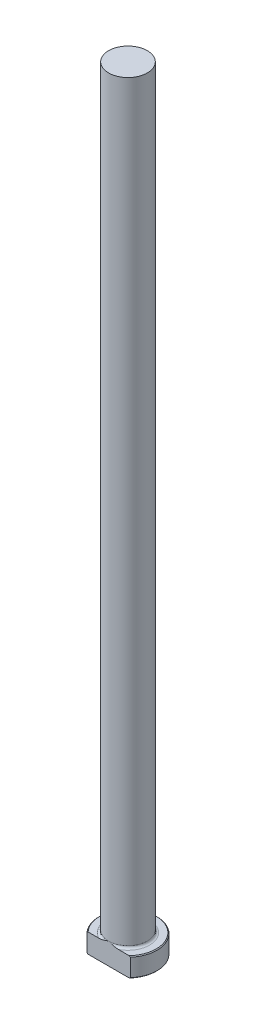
ISO-10303-21;
HEADER;
FILE_DESCRIPTION(('STEP AP214'),'2;1');
FILE_NAME('part.step','',(''),(''),'','','');
FILE_SCHEMA(('AUTOMOTIVE_DESIGN { 1 0 10303 214 1 1 1 1 }'));
ENDSEC;
DATA;
#1=APPLICATION_CONTEXT('core data for automotive mechanical design processes');
#2=APPLICATION_PROTOCOL_DEFINITION('international standard','automotive_design',2000,#1);
#3=PRODUCT_CONTEXT('',#1,'mechanical');
#4=PRODUCT('Part','Part','',(#3));
#5=PRODUCT_RELATED_PRODUCT_CATEGORY('part','',(#4));
#6=PRODUCT_DEFINITION_FORMATION('','',#4);
#7=PRODUCT_DEFINITION_CONTEXT('part definition',#1,'design');
#8=PRODUCT_DEFINITION('design','',#6,#7);
#9=PRODUCT_DEFINITION_SHAPE('','',#8);
#10=(LENGTH_UNIT() NAMED_UNIT(*) SI_UNIT(.MILLI.,.METRE.));
#11=(NAMED_UNIT(*) PLANE_ANGLE_UNIT() SI_UNIT($,.RADIAN.));
#12=(NAMED_UNIT(*) SI_UNIT($,.STERADIAN.) SOLID_ANGLE_UNIT());
#13=UNCERTAINTY_MEASURE_WITH_UNIT(LENGTH_MEASURE(1.E-05),#10,'distance_accuracy_value','');
#14=(GEOMETRIC_REPRESENTATION_CONTEXT(3) GLOBAL_UNCERTAINTY_ASSIGNED_CONTEXT((#13)) GLOBAL_UNIT_ASSIGNED_CONTEXT((#10,
#11,#12)) REPRESENTATION_CONTEXT('',''));
#15=CARTESIAN_POINT('',(0.,0.,0.));
#16=DIRECTION('',(0.,0.,1.));
#17=DIRECTION('',(1.,0.,0.));
#18=AXIS2_PLACEMENT_3D('',#15,#16,#17);
#19=CARTESIAN_POINT('',(0.,0.,0.));
#20=DIRECTION('',(0.,-1.,0.));
#21=DIRECTION('',(0.,0.,-1.));
#22=AXIS2_PLACEMENT_3D('',#19,#20,#21);
#23=PLANE('',#22);
#24=CARTESIAN_POINT('',(0.,0.,0.));
#25=DIRECTION('',(0.,-1.,0.));
#26=DIRECTION('',(0.,0.,-1.));
#27=AXIS2_PLACEMENT_3D('',#24,#25,#26);
#28=CIRCLE('',#27,9.271);
#29=CARTESIAN_POINT('',(-6.75491976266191,0.,6.34999999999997));
#30=VERTEX_POINT('',#29);
#31=CARTESIAN_POINT('',(6.75491976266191,0.,6.34999999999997));
#32=VERTEX_POINT('',#31);
#33=EDGE_CURVE('E98',#30,#32,#28,.T.);
#34=ORIENTED_EDGE('',*,*,#33,.T.);
#35=DIRECTION('',(-1.,0.,0.));
#36=VECTOR('',#35,1.);
#37=CARTESIAN_POINT('',(-7.09951582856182,0.,6.34999999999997));
#38=LINE('',#37,#36);
#39=EDGE_CURVE('E83',#32,#30,#38,.T.);
#40=ORIENTED_EDGE('',*,*,#39,.T.);
#41=EDGE_LOOP('',(#34,#40));
#42=FACE_BOUND('',#41,.T.);
#43=ADVANCED_FACE('F32',(#42),#23,.T.);
#44=CARTESIAN_POINT('',(0.,259.958771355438,0.));
#45=DIRECTION('',(0.,1.,0.));
#46=DIRECTION('',(0.,0.,1.));
#47=AXIS2_PLACEMENT_3D('',#44,#45,#46);
#48=CYLINDRICAL_SURFACE('',#47,9.52499999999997);
#49=CARTESIAN_POINT('',(0.,6.09600000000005,0.));
#50=DIRECTION('',(0.,1.,0.));
#51=DIRECTION('',(0.,0.,1.));
#52=AXIS2_PLACEMENT_3D('',#49,#50,#51);
#53=CIRCLE('',#52,9.52499999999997);
#54=CARTESIAN_POINT('',(-7.09951582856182,6.09600000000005,6.34999999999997));
#55=VERTEX_POINT('',#54);
#56=CARTESIAN_POINT('',(7.09951582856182,6.09600000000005,6.34999999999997));
#57=VERTEX_POINT('',#56);
#58=EDGE_CURVE('E104',#55,#57,#53,.F.);
#59=ORIENTED_EDGE('',*,*,#58,.T.);
#60=DIRECTION('',(0.,-1.,0.));
#61=VECTOR('',#60,1.);
#62=CARTESIAN_POINT('',(7.09951582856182,254.,6.34999999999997));
#63=LINE('',#62,#61);
#64=CARTESIAN_POINT('',(7.09951582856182,0.253999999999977,6.34999999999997));
#65=VERTEX_POINT('',#64);
#66=EDGE_CURVE('E183',#57,#65,#63,.T.);
#67=ORIENTED_EDGE('',*,*,#66,.T.);
#68=CARTESIAN_POINT('',(0.,0.253999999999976,0.));
#69=DIRECTION('',(0.,-1.,0.));
#70=DIRECTION('',(0.,0.,-1.));
#71=AXIS2_PLACEMENT_3D('',#68,#69,#70);
#72=CIRCLE('',#71,9.52499999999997);
#73=CARTESIAN_POINT('',(-7.09951582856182,0.253999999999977,6.34999999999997));
#74=VERTEX_POINT('',#73);
#75=EDGE_CURVE('E100',#65,#74,#72,.F.);
#76=ORIENTED_EDGE('',*,*,#75,.T.);
#77=DIRECTION('',(0.,-1.,0.));
#78=VECTOR('',#77,1.);
#79=CARTESIAN_POINT('',(-7.09951582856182,254.,6.34999999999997));
#80=LINE('',#79,#78);
#81=EDGE_CURVE('E93',#55,#74,#80,.T.);
#82=ORIENTED_EDGE('',*,*,#81,.F.);
#83=EDGE_LOOP('',(#59,#67,#76,#82));
#84=FACE_BOUND('',#83,.T.);
#85=ADVANCED_FACE('F158',(#84),#48,.T.);
#86=CARTESIAN_POINT('',(-9.52499999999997,6.35,0.));
#87=DIRECTION('',(0.,1.,0.));
#88=DIRECTION('',(0.,0.,1.));
#89=AXIS2_PLACEMENT_3D('',#86,#87,#88);
#90=PLANE('',#89);
#91=CARTESIAN_POINT('',(0.,6.35,0.));
#92=DIRECTION('',(0.,1.,0.));
#93=DIRECTION('',(0.,0.,1.));
#94=AXIS2_PLACEMENT_3D('',#91,#92,#93);
#95=CIRCLE('',#94,9.27100000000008);
#96=CARTESIAN_POINT('',(6.75491976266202,6.35,6.34999999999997));
#97=VERTEX_POINT('',#96);
#98=CARTESIAN_POINT('',(-6.75491976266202,6.35,6.34999999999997));
#99=VERTEX_POINT('',#98);
#100=EDGE_CURVE('E178',#97,#99,#95,.T.);
#101=ORIENTED_EDGE('',*,*,#100,.T.);
#102=DIRECTION('',(1.,0.,0.));
#103=VECTOR('',#102,1.);
#104=CARTESIAN_POINT('',(-9.52499999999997,6.35,6.34999999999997));
#105=LINE('',#104,#103);
#106=CARTESIAN_POINT('',(-3.20281813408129,6.35000000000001,6.34999999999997));
#107=VERTEX_POINT('',#106);
#108=EDGE_CURVE('E57',#99,#107,#105,.T.);
#109=ORIENTED_EDGE('',*,*,#108,.T.);
#110=CARTESIAN_POINT('',(0.,6.35,0.));
#111=DIRECTION('',(0.,1.,0.));
#112=DIRECTION('',(0.,0.,1.));
#113=AXIS2_PLACEMENT_3D('',#110,#111,#112);
#114=CIRCLE('',#113,7.11199999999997);
#115=CARTESIAN_POINT('',(3.20281813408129,6.35000000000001,6.34999999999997));
#116=VERTEX_POINT('',#115);
#117=EDGE_CURVE('E107',#107,#116,#114,.F.);
#118=ORIENTED_EDGE('',*,*,#117,.T.);
#119=EDGE_CURVE('E136',#116,#97,#105,.T.);
#120=ORIENTED_EDGE('',*,*,#119,.T.);
#121=EDGE_LOOP('',(#101,#109,#118,#120));
#122=FACE_BOUND('',#121,.T.);
#123=ADVANCED_FACE('F147',(#122),#90,.T.);
#124=CARTESIAN_POINT('',(0.,6.35000000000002,0.));
#125=DIRECTION('',(0.,-1.,0.));
#126=DIRECTION('',(0.,0.,-1.));
#127=AXIS2_PLACEMENT_3D('',#124,#125,#126);
#128=CONICAL_SURFACE('',#127,9.27100000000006,0.785398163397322);
#129=ORIENTED_EDGE('',*,*,#58,.F.);
#130=CARTESIAN_POINT('',(-15.620497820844,-1.24086384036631,6.34999999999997));
#131=CARTESIAN_POINT('',(-15.3857047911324,-1.02336008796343,6.34999999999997));
#132=CARTESIAN_POINT('',(-15.1505693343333,-0.806226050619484,6.34999999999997));
#133=CARTESIAN_POINT('',(-14.6795103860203,-0.372811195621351,6.34999999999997));
#134=CARTESIAN_POINT('',(-14.4435868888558,-0.156530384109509,6.34999999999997));
#135=CARTESIAN_POINT('',(-13.7343831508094,0.490949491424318,6.34999999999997));
#136=CARTESIAN_POINT('',(-13.2597703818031,0.920692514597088,6.34999999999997));
#137=CARTESIAN_POINT('',(-12.3030369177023,1.77753207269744,6.34999999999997));
#138=CARTESIAN_POINT('',(-11.8208883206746,2.20459751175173,6.34999999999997));
#139=CARTESIAN_POINT('',(-10.8502816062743,3.05140730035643,6.34999999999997));
#140=CARTESIAN_POINT('',(-10.361824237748,3.47115250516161,6.34999999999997));
#141=CARTESIAN_POINT('',(-9.47483904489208,4.21707154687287,6.34999999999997));
#142=CARTESIAN_POINT('',(-9.07790966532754,4.54513737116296,6.34999999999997));
#143=CARTESIAN_POINT('',(-8.47677412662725,5.030235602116,6.34999999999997));
#144=CARTESIAN_POINT('',(-8.27541054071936,5.19078991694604,6.34999999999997));
#145=CARTESIAN_POINT('',(-7.87046621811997,5.50907445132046,6.34999999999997));
#146=CARTESIAN_POINT('',(-7.66688552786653,5.66680472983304,6.34999999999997));
#147=CARTESIAN_POINT('',(-7.25735517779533,5.97869148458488,6.34999999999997));
#148=CARTESIAN_POINT('',(-7.05140838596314,6.13285171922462,6.34999999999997));
#149=CARTESIAN_POINT('',(-6.63647957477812,6.43702261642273,6.34999999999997));
#150=CARTESIAN_POINT('',(-6.42749769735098,6.58703347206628,6.34999999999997));
#151=CARTESIAN_POINT('',(-6.00602408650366,6.88188396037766,6.34999999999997));
#152=CARTESIAN_POINT('',(-5.79353372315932,7.02672554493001,6.34999999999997));
#153=CARTESIAN_POINT('',(-5.36434063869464,7.31000426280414,6.34999999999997));
#154=CARTESIAN_POINT('',(-5.14763839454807,7.44844211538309,6.34999999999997));
#155=CARTESIAN_POINT('',(-4.71552234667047,7.71338638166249,6.34999999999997));
#156=CARTESIAN_POINT('',(-4.50024913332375,7.84012086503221,6.34999999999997));
#157=CARTESIAN_POINT('',(-4.06421720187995,8.08391309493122,6.34999999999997));
#158=CARTESIAN_POINT('',(-3.84345787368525,8.20096975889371,6.34999999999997));
#159=CARTESIAN_POINT('',(-3.39588009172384,8.42261670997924,6.34999999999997));
#160=CARTESIAN_POINT('',(-3.16906543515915,8.52721459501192,6.34999999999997));
#161=CARTESIAN_POINT('',(-2.70873812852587,8.72055178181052,6.34999999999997));
#162=CARTESIAN_POINT('',(-2.4752273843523,8.80929554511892,6.34999999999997));
#163=CARTESIAN_POINT('',(-2.05336662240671,8.94953872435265,6.34999999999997));
#164=CARTESIAN_POINT('',(-1.86632074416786,9.00493855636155,6.34999999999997));
#165=CARTESIAN_POINT('',(-1.48854269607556,9.1014187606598,6.34999999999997));
#166=CARTESIAN_POINT('',(-1.29781098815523,9.14250091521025,6.34999999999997));
#167=CARTESIAN_POINT('',(-0.914152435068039,9.20830900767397,6.34999999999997));
#168=CARTESIAN_POINT('',(-0.721234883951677,9.23308834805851,6.34999999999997));
#169=CARTESIAN_POINT('',(-0.333938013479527,9.26515279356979,6.34999999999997));
#170=CARTESIAN_POINT('',(-0.139558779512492,9.27243891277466,6.34999999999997));
#171=CARTESIAN_POINT('',(0.249582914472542,9.26908452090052,6.34999999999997));
#172=CARTESIAN_POINT('',(0.444344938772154,9.25839414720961,6.34999999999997));
#173=CARTESIAN_POINT('',(0.832115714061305,9.2196193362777,6.34999999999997));
#174=CARTESIAN_POINT('',(1.02512432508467,9.19153352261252,6.34999999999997));
#175=CARTESIAN_POINT('',(1.40870622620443,9.11935938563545,6.34999999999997));
#176=CARTESIAN_POINT('',(1.59927002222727,9.07522133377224,6.34999999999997));
#177=CARTESIAN_POINT('',(1.97656776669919,8.97296890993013,6.34999999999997));
#178=CARTESIAN_POINT('',(2.16330153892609,8.9148538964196,6.34999999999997));
#179=CARTESIAN_POINT('',(2.55340558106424,8.77956545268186,6.34999999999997));
#180=CARTESIAN_POINT('',(2.75628314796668,8.7009832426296,6.34999999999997));
#181=CARTESIAN_POINT('',(3.15702163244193,8.53183500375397,6.34999999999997));
#182=CARTESIAN_POINT('',(3.35488038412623,8.44126390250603,6.34999999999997));
#183=CARTESIAN_POINT('',(3.74617402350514,8.25030745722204,6.34999999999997));
#184=CARTESIAN_POINT('',(3.93960103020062,8.14990608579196,6.34999999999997));
#185=CARTESIAN_POINT('',(4.32214375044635,7.94130427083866,6.34999999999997));
#186=CARTESIAN_POINT('',(4.5112600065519,7.83310481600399,6.34999999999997));
#187=CARTESIAN_POINT('',(4.88806427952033,7.60898083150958,6.34999999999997));
#188=CARTESIAN_POINT('',(5.07570450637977,7.49297632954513,6.34999999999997));
#189=CARTESIAN_POINT('',(5.44760916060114,7.25568772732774,6.34999999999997));
#190=CARTESIAN_POINT('',(5.63187351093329,7.13440350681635,6.34999999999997));
#191=CARTESIAN_POINT('',(5.99729074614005,6.88762375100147,6.34999999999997));
#192=CARTESIAN_POINT('',(6.17844648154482,6.76213242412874,6.34999999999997));
#193=CARTESIAN_POINT('',(6.53821557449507,6.50756961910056,6.34999999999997));
#194=CARTESIAN_POINT('',(6.71682895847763,6.37849817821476,6.34999999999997));
#195=CARTESIAN_POINT('',(7.09302388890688,6.1017900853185,6.34999999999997));
#196=CARTESIAN_POINT('',(7.29032688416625,5.95377527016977,6.34999999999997));
#197=CARTESIAN_POINT('',(7.682568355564,5.65464146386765,6.34999999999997));
#198=CARTESIAN_POINT('',(7.87750676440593,5.50352238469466,6.34999999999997));
#199=CARTESIAN_POINT('',(8.45932112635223,5.04627326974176,6.34999999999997));
#200=CARTESIAN_POINT('',(8.84315989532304,4.73627837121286,6.34999999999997));
#201=CARTESIAN_POINT('',(9.60509700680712,4.10866416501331,6.34999999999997));
#202=CARTESIAN_POINT('',(9.98318985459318,3.79103822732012,6.34999999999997));
#203=CARTESIAN_POINT('',(10.734716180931,3.1503109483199,6.34999999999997));
#204=CARTESIAN_POINT('',(11.1081495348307,2.82720946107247,6.34999999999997));
#205=CARTESIAN_POINT('',(11.8301543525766,2.19541462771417,6.34999999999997));
#206=CARTESIAN_POINT('',(12.1789280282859,1.88695183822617,6.34999999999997));
#207=CARTESIAN_POINT('',(12.8738739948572,1.26709898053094,6.34999999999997));
#208=CARTESIAN_POINT('',(13.2200462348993,0.955708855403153,6.34999999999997));
#209=CARTESIAN_POINT('',(13.9095994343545,0.331196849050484,6.34999999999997));
#210=CARTESIAN_POINT('',(14.2529845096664,0.0180795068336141,6.34999999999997));
#211=CARTESIAN_POINT('',(14.9379801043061,-0.610061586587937,6.34999999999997));
#212=CARTESIAN_POINT('',(15.2795906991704,-0.925085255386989,6.34999999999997));
#213=CARTESIAN_POINT('',(15.620497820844,-1.24086384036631,6.34999999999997));
#214=B_SPLINE_CURVE_WITH_KNOTS('',3,(#130,#131,#132,#133,#134,#135,#136,#137,#138,#139,#140,
#141,#142,#143,#144,#145,#146,#147,#148,#149,#150,#151,#152,#153,#154,#155,#156,#157,#158,#159,
#160,#161,#162,#163,#164,#165,#166,#167,#168,#169,#170,#171,#172,#173,#174,#175,#176,#177,#178,
#179,#180,#181,#182,#183,#184,#185,#186,#187,#188,#189,#190,#191,#192,#193,#194,#195,#196,#197,
#198,#199,#200,#201,#202,#203,#204,#205,#206,#207,#208,#209,#210,#211,#212,#213),.UNSPECIFIED.,
.F.,.F.,(4,2,2,2,2,2,2,2,2,2,2,2,2,2,2,2,2,2,2,2,2,2,2,2,2,2,2,2,2,2,2,2,2,2,2,2,2,2,2,2,2,4),
(0.,0.960166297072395,1.92033949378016,3.84109812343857,5.77331872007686,7.70531203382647,
9.25006454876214,10.0226538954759,10.7952270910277,11.5669461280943,12.3386291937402,
13.1100177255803,13.8813194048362,14.6305489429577,15.3798621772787,16.1287160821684,
16.8773589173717,17.4621154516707,18.0467991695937,18.6295579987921,19.2122830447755,
19.7966271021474,20.3810174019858,20.9672337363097,21.5534769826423,22.2056947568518,
22.8581893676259,23.5117661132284,24.1652601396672,24.8269639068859,25.4886827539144,
26.1497583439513,26.8108270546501,27.5507428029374,28.2906795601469,29.7706888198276,
31.2520340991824,32.7334189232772,34.1302286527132,35.5270655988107,36.921189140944,
38.3152528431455),.UNSPECIFIED.);
#215=EDGE_CURVE('E135',#55,#99,#214,.T.);
#216=ORIENTED_EDGE('',*,*,#215,.T.);
#217=ORIENTED_EDGE('',*,*,#100,.F.);
#218=EDGE_CURVE('E127',#97,#57,#214,.T.);
#219=ORIENTED_EDGE('',*,*,#218,.T.);
#220=EDGE_LOOP('',(#129,#216,#217,#219));
#221=FACE_BOUND('',#220,.T.);
#222=ADVANCED_FACE('F143',(#221),#128,.T.);
#223=CARTESIAN_POINT('',(0.,0.253999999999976,0.));
#224=DIRECTION('',(0.,1.,0.));
#225=DIRECTION('',(0.,0.,1.));
#226=AXIS2_PLACEMENT_3D('',#223,#224,#225);
#227=CONICAL_SURFACE('',#226,9.52499999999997,0.785398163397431);
#228=ORIENTED_EDGE('',*,*,#75,.F.);
#229=CARTESIAN_POINT('',(15.620497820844,7.59086384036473,6.34999999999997));
#230=CARTESIAN_POINT('',(15.3857047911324,7.37336008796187,6.34999999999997));
#231=CARTESIAN_POINT('',(15.1505693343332,7.15622605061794,6.34999999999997));
#232=CARTESIAN_POINT('',(14.6795103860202,6.72281119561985,6.34999999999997));
#233=CARTESIAN_POINT('',(14.4435868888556,6.50653038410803,6.34999999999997));
#234=CARTESIAN_POINT('',(13.7343831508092,5.85905050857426,6.34999999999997));
#235=CARTESIAN_POINT('',(13.2597703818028,5.42930748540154,6.34999999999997));
#236=CARTESIAN_POINT('',(12.3030369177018,4.57246792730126,6.34999999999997));
#237=CARTESIAN_POINT('',(11.8208883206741,4.14540248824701,6.34999999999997));
#238=CARTESIAN_POINT('',(10.8502816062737,3.29859269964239,6.34999999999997));
#239=CARTESIAN_POINT('',(10.3618242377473,2.87884749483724,6.34999999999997));
#240=CARTESIAN_POINT('',(9.47483904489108,2.1329284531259,6.34999999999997));
#241=CARTESIAN_POINT('',(9.0779096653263,1.80486262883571,6.34999999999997));
#242=CARTESIAN_POINT('',(8.47677412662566,1.31976439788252,6.34999999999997));
#243=CARTESIAN_POINT('',(8.27541054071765,1.15921008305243,6.34999999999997));
#244=CARTESIAN_POINT('',(7.87046621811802,0.840925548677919,6.34999999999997));
#245=CARTESIAN_POINT('',(7.66688552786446,0.683195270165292,6.34999999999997));
#246=CARTESIAN_POINT('',(7.257355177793,0.371308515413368,6.34999999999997));
#247=CARTESIAN_POINT('',(7.05140838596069,0.217148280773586,6.34999999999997));
#248=CARTESIAN_POINT('',(6.63647957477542,-0.0870226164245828,6.34999999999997));
#249=CARTESIAN_POINT('',(6.42749769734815,-0.237033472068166,6.34999999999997));
#250=CARTESIAN_POINT('',(6.00602408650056,-0.531883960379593,6.34999999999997));
#251=CARTESIAN_POINT('',(5.79353372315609,-0.676725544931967,6.34999999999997));
#252=CARTESIAN_POINT('',(5.36434063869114,-0.960004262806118,6.34999999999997));
#253=CARTESIAN_POINT('',(5.14763839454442,-1.09844211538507,6.34999999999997));
#254=CARTESIAN_POINT('',(4.71552234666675,-1.36338638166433,6.34999999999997));
#255=CARTESIAN_POINT('',(4.5002491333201,-1.49012086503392,6.34999999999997));
#256=CARTESIAN_POINT('',(4.06421720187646,-1.73391309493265,6.34999999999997));
#257=CARTESIAN_POINT('',(3.84345787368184,-1.85096975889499,6.34999999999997));
#258=CARTESIAN_POINT('',(3.39588009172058,-2.07261670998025,6.34999999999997));
#259=CARTESIAN_POINT('',(3.16906543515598,-2.17721459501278,6.34999999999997));
#260=CARTESIAN_POINT('',(2.70873812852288,-2.3705517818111,6.34999999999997));
#261=CARTESIAN_POINT('',(2.4752273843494,-2.45929554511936,6.34999999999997));
#262=CARTESIAN_POINT('',(2.05336662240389,-2.59953872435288,6.34999999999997));
#263=CARTESIAN_POINT('',(1.86632074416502,-2.6549385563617,6.34999999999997));
#264=CARTESIAN_POINT('',(1.48854269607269,-2.75141876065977,6.34999999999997));
#265=CARTESIAN_POINT('',(1.29781098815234,-2.79250091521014,6.34999999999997));
#266=CARTESIAN_POINT('',(0.914152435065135,-2.85830900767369,6.34999999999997));
#267=CARTESIAN_POINT('',(0.721234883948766,-2.88308834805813,6.34999999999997));
#268=CARTESIAN_POINT('',(0.333938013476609,-2.91515279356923,6.34999999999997));
#269=CARTESIAN_POINT('',(0.139558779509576,-2.922438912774,6.34999999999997));
#270=CARTESIAN_POINT('',(-0.249582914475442,-2.91908452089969,6.34999999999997));
#271=CARTESIAN_POINT('',(-0.444344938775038,-2.9083941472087,6.34999999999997));
#272=CARTESIAN_POINT('',(-0.832115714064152,-2.86961933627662,6.34999999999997));
#273=CARTESIAN_POINT('',(-1.0251243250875,-2.84153352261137,6.34999999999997));
#274=CARTESIAN_POINT('',(-1.4087062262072,-2.76935938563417,6.34999999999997));
#275=CARTESIAN_POINT('',(-1.59927002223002,-2.72522133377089,6.34999999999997));
#276=CARTESIAN_POINT('',(-1.97656776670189,-2.62296890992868,6.34999999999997));
#277=CARTESIAN_POINT('',(-2.16330153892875,-2.5648538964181,6.34999999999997));
#278=CARTESIAN_POINT('',(-2.55340558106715,-2.42956545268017,6.34999999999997));
#279=CARTESIAN_POINT('',(-2.75628314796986,-2.35098324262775,6.34999999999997));
#280=CARTESIAN_POINT('',(-3.15702163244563,-2.18183500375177,6.34999999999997));
#281=CARTESIAN_POINT('',(-3.35488038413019,-2.09126390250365,6.34999999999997));
#282=CARTESIAN_POINT('',(-3.7461740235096,-1.90030745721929,6.34999999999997));
#283=CARTESIAN_POINT('',(-3.93960103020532,-1.79990608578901,6.34999999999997));
#284=CARTESIAN_POINT('',(-4.32214375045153,-1.59130427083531,6.34999999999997));
#285=CARTESIAN_POINT('',(-4.51126000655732,-1.48310481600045,6.34999999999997));
#286=CARTESIAN_POINT('',(-4.88806427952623,-1.25898083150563,6.34999999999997));
#287=CARTESIAN_POINT('',(-5.0757045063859,-1.14297632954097,6.34999999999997));
#288=CARTESIAN_POINT('',(-5.44760916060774,-0.905687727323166,6.34999999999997));
#289=CARTESIAN_POINT('',(-5.63187351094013,-0.784403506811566,6.34999999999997));
#290=CARTESIAN_POINT('',(-5.99729074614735,-0.537623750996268,6.34999999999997));
#291=CARTESIAN_POINT('',(-6.17844648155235,-0.412132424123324,6.34999999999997));
#292=CARTESIAN_POINT('',(-6.53821557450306,-0.157569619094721,6.34999999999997));
#293=CARTESIAN_POINT('',(-6.71682895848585,-0.0284981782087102,6.34999999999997));
#294=CARTESIAN_POINT('',(-7.09302388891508,0.248209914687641,6.34999999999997));
#295=CARTESIAN_POINT('',(-7.29032688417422,0.396224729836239,6.34999999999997));
#296=CARTESIAN_POINT('',(-7.68256835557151,0.695358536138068,6.34999999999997));
#297=CARTESIAN_POINT('',(-7.87750676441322,0.846477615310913,6.34999999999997));
#298=CARTESIAN_POINT('',(-8.45932112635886,1.30372673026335,6.34999999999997));
#299=CARTESIAN_POINT('',(-8.84315989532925,1.61372162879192,6.34999999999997));
#300=CARTESIAN_POINT('',(-9.60509700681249,2.24133583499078,6.34999999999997));
#301=CARTESIAN_POINT('',(-9.98318985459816,2.5589617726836,6.34999999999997));
#302=CARTESIAN_POINT('',(-10.7347161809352,3.19968905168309,6.34999999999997));
#303=CARTESIAN_POINT('',(-11.1081495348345,3.52279053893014,6.34999999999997));
#304=CARTESIAN_POINT('',(-11.8301543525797,4.15458537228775,6.34999999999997));
#305=CARTESIAN_POINT('',(-12.1789280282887,4.46304816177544,6.34999999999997));
#306=CARTESIAN_POINT('',(-12.8738739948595,5.08290101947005,6.34999999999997));
#307=CARTESIAN_POINT('',(-13.2200462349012,5.39429114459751,6.34999999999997));
#308=CARTESIAN_POINT('',(-13.9095994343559,6.01880315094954,6.34999999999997));
#309=CARTESIAN_POINT('',(-14.2529845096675,6.33192049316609,6.34999999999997));
#310=CARTESIAN_POINT('',(-14.9379801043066,6.960061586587,6.34999999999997));
#311=CARTESIAN_POINT('',(-15.2795906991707,7.27508525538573,6.34999999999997));
#312=CARTESIAN_POINT('',(-15.620497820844,7.59086384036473,6.34999999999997));
#313=B_SPLINE_CURVE_WITH_KNOTS('',3,(#229,#230,#231,#232,#233,#234,#235,#236,#237,#238,#239,
#240,#241,#242,#243,#244,#245,#246,#247,#248,#249,#250,#251,#252,#253,#254,#255,#256,#257,#258,
#259,#260,#261,#262,#263,#264,#265,#266,#267,#268,#269,#270,#271,#272,#273,#274,#275,#276,#277,
#278,#279,#280,#281,#282,#283,#284,#285,#286,#287,#288,#289,#290,#291,#292,#293,#294,#295,#296,
#297,#298,#299,#300,#301,#302,#303,#304,#305,#306,#307,#308,#309,#310,#311,#312),.UNSPECIFIED.,
.F.,.F.,(4,2,2,2,2,2,2,2,2,2,2,2,2,2,2,2,2,2,2,2,2,2,2,2,2,2,2,2,2,2,2,2,2,2,2,2,2,2,2,2,2,4),
(0.,0.960166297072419,1.92033949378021,3.84109812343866,5.77331872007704,7.70531203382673,
9.25006454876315,10.0226538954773,10.7952270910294,11.5669461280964,12.3386291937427,
13.1100177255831,13.8813194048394,14.6305489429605,15.3798621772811,16.1287160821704,
16.8773589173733,17.4621154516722,18.0467991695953,18.6295579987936,19.212283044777,
19.7966271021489,20.3810174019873,20.9672337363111,21.5534769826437,22.2056947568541,
22.8581893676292,23.5117661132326,24.1652601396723,24.826963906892,25.4886827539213,
26.1497583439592,26.8108270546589,27.5507428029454,28.2906795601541,29.7706888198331,
31.2520340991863,32.7334189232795,34.1302286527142,35.5270655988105,36.9211891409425,
38.3152528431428),.UNSPECIFIED.);
#314=EDGE_CURVE('E86',#65,#32,#313,.T.);
#315=ORIENTED_EDGE('',*,*,#314,.T.);
#316=ORIENTED_EDGE('',*,*,#33,.F.);
#317=EDGE_CURVE('E89',#30,#74,#313,.T.);
#318=ORIENTED_EDGE('',*,*,#317,.T.);
#319=EDGE_LOOP('',(#228,#315,#316,#318));
#320=FACE_BOUND('',#319,.T.);
#321=ADVANCED_FACE('F97',(#320),#227,.T.);
#322=CARTESIAN_POINT('',(0.,7.11200000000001,0.));
#323=DIRECTION('',(0.,1.,0.));
#324=DIRECTION('',(0.,0.,1.));
#325=AXIS2_PLACEMENT_3D('',#322,#323,#324);
#326=TOROIDAL_SURFACE('',#325,7.11199999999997,0.762);
#327=CARTESIAN_POINT('',(0.,7.11200000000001,6.34999999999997));
#328=CARTESIAN_POINT('',(-1.98730332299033E-11,7.11200099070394,6.34999999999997));
#329=CARTESIAN_POINT('',(2.54281773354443E-07,7.11200198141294,6.34999999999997));
#330=CARTESIAN_POINT('',(1.0280306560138E-06,7.11200387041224,6.34999999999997));
#331=CARTESIAN_POINT('',(1.55832945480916E-06,7.11200476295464,6.34999999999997));
#332=CARTESIAN_POINT('',(2.82630076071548E-06,7.11200655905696,6.34999999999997));
#333=CARTESIAN_POINT('',(3.5815916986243E-06,7.11200745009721,6.34999999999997));
#334=CARTESIAN_POINT('',(5.19075123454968E-06,7.11200910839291,6.34999999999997));
#335=CARTESIAN_POINT('',(6.0431182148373E-06,7.11200987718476,6.34999999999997));
#336=CARTESIAN_POINT('',(9.16920499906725E-06,7.11201253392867,6.34999999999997));
#337=CARTESIAN_POINT('',(1.15677962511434E-05,7.11201427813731,6.34999999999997));
#338=CARTESIAN_POINT('',(1.64593528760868E-05,7.11201731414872,6.34999999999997));
#339=CARTESIAN_POINT('',(1.89415872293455E-05,7.11201862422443,6.34999999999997));
#340=CARTESIAN_POINT('',(2.88859728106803E-05,7.11202372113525,6.34999999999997));
#341=CARTESIAN_POINT('',(3.64752267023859E-05,7.11202727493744,6.34999999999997));
#342=CARTESIAN_POINT('',(5.12411228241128E-05,7.11203291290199,6.34999999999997));
#343=CARTESIAN_POINT('',(5.83739462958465E-05,7.11203511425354,6.34999999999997));
#344=CARTESIAN_POINT('',(8.94436376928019E-05,7.11204475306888,6.34999999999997));
#345=CARTESIAN_POINT('',(0.000113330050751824,7.11205229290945,6.34999999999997));
#346=CARTESIAN_POINT('',(0.000157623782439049,7.11206410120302,6.34999999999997));
#347=CARTESIAN_POINT('',(0.000177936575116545,7.11206870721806,6.34999999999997));
#348=CARTESIAN_POINT('',(0.000328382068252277,7.11210592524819,6.34999999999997));
#349=CARTESIAN_POINT('',(0.00045394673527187,7.1121544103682,6.34999999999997));
#350=CARTESIAN_POINT('',(0.000946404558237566,7.11233771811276,6.34999999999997));
#351=CARTESIAN_POINT('',(0.00131646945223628,7.11246069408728,6.34999999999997));
#352=CARTESIAN_POINT('',(0.00276809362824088,7.11295007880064,6.34999999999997));
#353=CARTESIAN_POINT('',(0.00384642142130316,7.11332889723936,6.34999999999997));
#354=CARTESIAN_POINT('',(0.0083006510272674,7.11488653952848,6.34999999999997));
#355=CARTESIAN_POINT('',(0.0116800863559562,7.1160514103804,6.34999999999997));
#356=CARTESIAN_POINT('',(0.0812880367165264,7.14005423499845,6.34999999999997));
#357=CARTESIAN_POINT('',(0.147476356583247,7.1630529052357,6.34999999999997));
#358=CARTESIAN_POINT('',(0.27735683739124,7.20792044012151,6.34999999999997));
#359=CARTESIAN_POINT('',(0.341046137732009,7.22979850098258,6.34999999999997));
#360=CARTESIAN_POINT('',(0.476297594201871,7.27596846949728,6.34999999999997));
#361=CARTESIAN_POINT('',(0.547870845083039,7.30022868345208,6.34999999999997));
#362=CARTESIAN_POINT('',(0.691958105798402,7.34848126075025,6.34999999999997));
#363=CARTESIAN_POINT('',(0.764473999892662,7.37246799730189,6.34999999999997));
#364=CARTESIAN_POINT('',(0.889840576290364,7.4132466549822,6.34999999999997));
#365=CARTESIAN_POINT('',(0.942635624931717,7.43020921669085,6.34999999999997));
#366=CARTESIAN_POINT('',(1.04823844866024,7.46363183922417,6.34999999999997));
#367=CARTESIAN_POINT('',(1.10104585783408,7.48009305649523,6.34999999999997));
#368=CARTESIAN_POINT('',(1.25725277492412,7.5279153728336,6.34999999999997));
#369=CARTESIAN_POINT('',(1.360886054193,7.55851914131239,6.34999999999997));
#370=CARTESIAN_POINT('',(1.59088732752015,7.62320257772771,6.34999999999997));
#371=CARTESIAN_POINT('',(1.71743494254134,7.65665155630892,6.34999999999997));
#372=CARTESIAN_POINT('',(1.97280417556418,7.71848782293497,6.34999999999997));
#373=CARTESIAN_POINT('',(2.10163577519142,7.74683457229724,6.34999999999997));
#374=CARTESIAN_POINT('',(2.3700410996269,7.79828507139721,6.34999999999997));
#375=CARTESIAN_POINT('',(2.50971812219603,7.82086167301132,6.34999999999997));
#376=CARTESIAN_POINT('',(2.79011040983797,7.85525616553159,6.34999999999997));
#377=CARTESIAN_POINT('',(2.93082167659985,7.86710398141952,6.34999999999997));
#378=CARTESIAN_POINT('',(3.14072761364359,7.87407656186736,6.34999999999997));
#379=CARTESIAN_POINT('',(3.20974558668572,7.87465175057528,6.34999999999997));
#380=CARTESIAN_POINT('',(3.34768897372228,7.87178528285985,6.34999999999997));
#381=CARTESIAN_POINT('',(3.41661441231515,7.86834509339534,6.34999999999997));
#382=CARTESIAN_POINT('',(3.55295435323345,7.856840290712,6.34999999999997));
#383=CARTESIAN_POINT('',(3.62037508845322,7.8488524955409,6.34999999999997));
#384=CARTESIAN_POINT('',(3.75432209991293,7.82745899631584,6.34999999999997));
#385=CARTESIAN_POINT('',(3.82084914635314,7.81405831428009,6.34999999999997));
#386=CARTESIAN_POINT('',(3.94402160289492,7.78281890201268,6.34999999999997));
#387=CARTESIAN_POINT('',(4.00085861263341,7.76574904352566,6.34999999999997));
#388=CARTESIAN_POINT('',(4.11269317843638,7.72554243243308,6.34999999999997));
#389=CARTESIAN_POINT('',(4.16768138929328,7.70237893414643,6.34999999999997));
#390=CARTESIAN_POINT('',(4.274754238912,7.64845340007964,6.34999999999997));
#391=CARTESIAN_POINT('',(4.32679331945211,7.61759890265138,6.34999999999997));
#392=CARTESIAN_POINT('',(4.42436914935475,7.54697047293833,6.34999999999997));
#393=CARTESIAN_POINT('',(4.46994081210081,7.50724766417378,6.34999999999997));
#394=CARTESIAN_POINT('',(4.53046555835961,7.43959446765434,6.34999999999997));
#395=CARTESIAN_POINT('',(4.54952297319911,7.41533971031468,6.34999999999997));
#396=CARTESIAN_POINT('',(4.58379853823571,7.36421578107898,6.34999999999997));
#397=CARTESIAN_POINT('',(4.59901798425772,7.33734749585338,6.34999999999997));
#398=CARTESIAN_POINT('',(4.6247071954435,7.28103780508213,6.34999999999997));
#399=CARTESIAN_POINT('',(4.63512457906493,7.25157201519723,6.34999999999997));
#400=CARTESIAN_POINT('',(4.64995843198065,7.1911663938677,6.34999999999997));
#401=CARTESIAN_POINT('',(4.6543827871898,7.16022855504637,6.34999999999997));
#402=CARTESIAN_POINT('',(4.65660008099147,7.1022078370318,6.34999999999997));
#403=CARTESIAN_POINT('',(4.65518871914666,7.07515315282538,6.34999999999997));
#404=CARTESIAN_POINT('',(4.64761946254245,7.02171954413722,6.34999999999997));
#405=CARTESIAN_POINT('',(4.64146071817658,6.99534074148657,6.34999999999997));
#406=CARTESIAN_POINT('',(4.62523755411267,6.94504159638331,6.34999999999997));
#407=CARTESIAN_POINT('',(4.61534502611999,6.92106470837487,6.34999999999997));
#408=CARTESIAN_POINT('',(4.59226170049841,6.8747751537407,6.34999999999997));
#409=CARTESIAN_POINT('',(4.5790700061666,6.8524629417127,6.34999999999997));
#410=CARTESIAN_POINT('',(4.5418218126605,6.79764783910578,6.34999999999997));
#411=CARTESIAN_POINT('',(4.51582520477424,6.76646268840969,6.34999999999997));
#412=CARTESIAN_POINT('',(4.45923244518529,6.70856515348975,6.34999999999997));
#413=CARTESIAN_POINT('',(4.42862238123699,6.68186683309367,6.34999999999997));
#414=CARTESIAN_POINT('',(4.34541293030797,6.61817721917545,6.34999999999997));
#415=CARTESIAN_POINT('',(4.29043455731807,6.58431535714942,6.34999999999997));
#416=CARTESIAN_POINT('',(4.17622180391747,6.52522207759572,6.34999999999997));
#417=CARTESIAN_POINT('',(4.11698677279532,6.49999198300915,6.34999999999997));
#418=CARTESIAN_POINT('',(4.00208843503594,6.4587014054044,6.34999999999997));
#419=CARTESIAN_POINT('',(3.9466577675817,6.4419775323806,6.34999999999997));
#420=CARTESIAN_POINT('',(3.83455009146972,6.41329756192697,6.34999999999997));
#421=CARTESIAN_POINT('',(3.77787201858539,6.40134571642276,6.34999999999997));
#422=CARTESIAN_POINT('',(3.66308050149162,6.38138585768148,6.34999999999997));
#423=CARTESIAN_POINT('',(3.60495797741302,6.37343127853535,6.34999999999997));
#424=CARTESIAN_POINT('',(3.4883799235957,6.36111790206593,6.34999999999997));
#425=CARTESIAN_POINT('',(3.42992460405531,6.35675704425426,6.34999999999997));
#426=CARTESIAN_POINT('',(3.29509240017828,6.35029195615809,6.34999999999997));
#427=CARTESIAN_POINT('',(3.2186642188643,6.34927526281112,6.34999999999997));
#428=CARTESIAN_POINT('',(3.06586811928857,6.35168618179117,6.34999999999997));
#429=CARTESIAN_POINT('',(2.98950023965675,6.35511565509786,6.34999999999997));
#430=CARTESIAN_POINT('',(2.76031250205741,6.3710761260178,6.34999999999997));
#431=CARTESIAN_POINT('',(2.607884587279,6.38929295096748,6.34999999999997));
#432=CARTESIAN_POINT('',(2.31432643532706,6.43528521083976,6.34999999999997));
#433=CARTESIAN_POINT('',(2.17308394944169,6.46239447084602,6.34999999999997));
#434=CARTESIAN_POINT('',(1.89333619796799,6.52366707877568,6.34999999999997));
#435=CARTESIAN_POINT('',(1.75481809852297,6.55777263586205,6.34999999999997));
#436=CARTESIAN_POINT('',(1.50173407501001,6.62528392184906,6.34999999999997));
#437=CARTESIAN_POINT('',(1.3869516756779,6.65789391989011,6.34999999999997));
#438=CARTESIAN_POINT('',(1.21403608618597,6.70931360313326,6.34999999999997));
#439=CARTESIAN_POINT('',(1.15559330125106,6.72709180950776,6.34999999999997));
#440=CARTESIAN_POINT('',(1.03875270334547,6.76331573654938,6.34999999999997));
#441=CARTESIAN_POINT('',(0.980355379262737,6.78176303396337,6.34999999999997));
#442=CARTESIAN_POINT('',(0.84182633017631,6.82619675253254,6.34999999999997));
#443=CARTESIAN_POINT('',(0.761768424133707,6.85241274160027,6.34999999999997));
#444=CARTESIAN_POINT('',(0.602738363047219,6.90528054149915,6.34999999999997));
#445=CARTESIAN_POINT('',(0.523763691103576,6.93192479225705,6.34999999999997));
#446=CARTESIAN_POINT('',(0.374563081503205,6.98270346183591,6.34999999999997));
#447=CARTESIAN_POINT('',(0.304322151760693,7.00679476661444,6.34999999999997));
#448=CARTESIAN_POINT('',(0.161086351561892,7.05623678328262,6.34999999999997));
#449=CARTESIAN_POINT('',(0.0880951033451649,7.0815989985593,6.34999999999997));
#450=CARTESIAN_POINT('',(0.0116796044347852,7.10794873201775,6.34999999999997));
#451=CARTESIAN_POINT('',(0.00829969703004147,7.10911378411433,6.34999999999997));
#452=CARTESIAN_POINT('',(0.0038453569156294,7.1106714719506,6.34999999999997));
#453=CARTESIAN_POINT('',(0.00276739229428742,7.11105016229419,6.34999999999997));
#454=CARTESIAN_POINT('',(0.0013162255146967,7.11153939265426,6.34999999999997));
#455=CARTESIAN_POINT('',(0.000946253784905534,7.11166233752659,6.34999999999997));
#456=CARTESIAN_POINT('',(0.000453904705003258,7.11184560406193,6.34999999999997));
#457=CARTESIAN_POINT('',(0.000328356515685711,7.11189408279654,6.34999999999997));
#458=CARTESIAN_POINT('',(0.000177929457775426,7.11193129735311,6.34999999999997));
#459=CARTESIAN_POINT('',(0.000157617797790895,7.11193590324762,6.34999999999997));
#460=CARTESIAN_POINT('',(0.000113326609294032,7.11194771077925,6.34999999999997));
#461=CARTESIAN_POINT('',(8.9441576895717E-05,7.11195524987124,6.34999999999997));
#462=CARTESIAN_POINT('',(5.83734289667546E-05,7.1119648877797,6.34999999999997));
#463=CARTESIAN_POINT('',(5.12407709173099E-05,7.11196708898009,6.34999999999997));
#464=CARTESIAN_POINT('',(3.64751950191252E-05,7.11197272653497,6.34999999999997));
#465=CARTESIAN_POINT('',(2.88860890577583E-05,7.11197628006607,6.34999999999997));
#466=CARTESIAN_POINT('',(1.89418472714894E-05,7.11198137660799,6.34999999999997));
#467=CARTESIAN_POINT('',(1.64596255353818E-05,7.11198268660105,6.34999999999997));
#468=CARTESIAN_POINT('',(1.15680783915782E-05,7.11198572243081,6.34999999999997));
#469=CARTESIAN_POINT('',(9.16948288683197E-06,7.11198746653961,6.34999999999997));
#470=CARTESIAN_POINT('',(6.04337167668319E-06,7.11199012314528,6.34999999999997));
#471=CARTESIAN_POINT('',(5.19099381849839E-06,7.11199089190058,6.34999999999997));
#472=CARTESIAN_POINT('',(3.58180595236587E-06,7.11199255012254,6.34999999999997));
#473=CARTESIAN_POINT('',(2.82649744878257E-06,7.11199344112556,6.34999999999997));
#474=CARTESIAN_POINT('',(1.55848394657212E-06,7.1119952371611,6.34999999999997));
#475=CARTESIAN_POINT('',(1.02816162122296E-06,7.11199612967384,6.34999999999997));
#476=CARTESIAN_POINT('',(2.54355049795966E-07,7.11199801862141,6.34999999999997));
#477=CARTESIAN_POINT('',(1.98727903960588E-11,7.11199900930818,6.34999999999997));
#478=CARTESIAN_POINT('',(0.,7.11200000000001,6.34999999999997));
#479=B_SPLINE_CURVE_WITH_KNOTS('',3,(#327,#328,#329,#330,#331,#332,#333,#334,#335,#336,#337,
#338,#339,#340,#341,#342,#343,#344,#345,#346,#347,#348,#349,#350,#351,#352,#353,#354,#355,#356,
#357,#358,#359,#360,#361,#362,#363,#364,#365,#366,#367,#368,#369,#370,#371,#372,#373,#374,#375,
#376,#377,#378,#379,#380,#381,#382,#383,#384,#385,#386,#387,#388,#389,#390,#391,#392,#393,#394,
#395,#396,#397,#398,#399,#400,#401,#402,#403,#404,#405,#406,#407,#408,#409,#410,#411,#412,#413,
#414,#415,#416,#417,#418,#419,#420,#421,#422,#423,#424,#425,#426,#427,#428,#429,#430,#431,#432,
#433,#434,#435,#436,#437,#438,#439,#440,#441,#442,#443,#444,#445,#446,#447,#448,#449,#450,#451,
#452,#453,#454,#455,#456,#457,#458,#459,#460,#461,#462,#463,#464,#465,#466,#467,#468,#469,#470,
#471,#472,#473,#474,#475,#476,#477,#478),.UNSPECIFIED.,.T.,.F.,(4,2,2,2,2,2,2,2,2,2,2,2,2,2,2,2,
2,2,2,2,2,2,2,2,2,2,2,2,2,2,2,2,2,2,2,2,2,2,2,2,2,2,2,2,2,2,2,2,2,2,2,2,2,2,2,2,2,2,2,2,2,2,2,2,
2,2,2,2,2,2,2,2,2,2,2,4),(0.,2.97433544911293E-06,6.07559574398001E-06,9.56379482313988E-06,
1.30039324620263E-05,2.18605341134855E-05,3.02738862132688E-05,5.53487649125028E-05,
7.77184254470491E-05,0.000152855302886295,0.000215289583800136,0.00061784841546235,
0.00178877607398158,0.0052162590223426,0.0159413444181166,0.226133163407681,0.428164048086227,
0.654880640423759,0.884018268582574,1.0503756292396,1.21631462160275,1.54046085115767,
1.93305663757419,2.32864586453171,2.75283206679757,3.17583144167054,3.38280101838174,
3.58969500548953,3.7931936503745,3.99650392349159,4.1742770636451,4.35284387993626,
4.53367075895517,4.71348096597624,4.80574017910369,4.89796820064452,4.99117974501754,
5.08426851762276,5.16511313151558,5.24597221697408,5.32349031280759,5.40102950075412,
5.52213385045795,5.64361099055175,5.83623332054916,6.02888515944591,6.20233104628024,
6.37593113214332,6.55179391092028,6.72755578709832,6.95669586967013,7.18593189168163,
7.64582563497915,8.0770692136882,8.50488455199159,8.86281618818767,9.04607408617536,
9.22979617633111,9.48251462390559,9.73255559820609,9.95533260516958,10.1871278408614,
10.1978544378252,10.2012807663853,10.2024513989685,10.202853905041,10.2029163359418,
10.2029914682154,10.2030138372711,10.203038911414,10.2030473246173,10.203056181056,
10.2030596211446,10.2030631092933,10.2030662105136,10.2030691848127),.UNSPECIFIED.);
#480=CARTESIAN_POINT('',(0.,7.11200000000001,6.34999999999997));
#481=VERTEX_POINT('',#480);
#482=EDGE_CURVE('E11',#116,#481,#479,.T.);
#483=ORIENTED_EDGE('',*,*,#482,.F.);
#484=ORIENTED_EDGE('',*,*,#117,.F.);
#485=CARTESIAN_POINT('',(0.,7.11200000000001,6.34999999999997));
#486=CARTESIAN_POINT('',(1.98732861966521E-11,7.11199900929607,6.34999999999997));
#487=CARTESIAN_POINT('',(-2.54281773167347E-07,7.11199801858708,6.34999999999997));
#488=CARTESIAN_POINT('',(-1.02803065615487E-06,7.11199612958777,6.34999999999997));
#489=CARTESIAN_POINT('',(-1.55832945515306E-06,7.11199523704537,6.34999999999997));
#490=CARTESIAN_POINT('',(-2.82630076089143E-06,7.11199344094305,6.34999999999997));
#491=CARTESIAN_POINT('',(-3.58159169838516E-06,7.1119925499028,6.34999999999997));
#492=CARTESIAN_POINT('',(-5.19075123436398E-06,7.1119908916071,6.34999999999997));
#493=CARTESIAN_POINT('',(-6.04311821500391E-06,7.11199012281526,6.34999999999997));
#494=CARTESIAN_POINT('',(-9.16920500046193E-06,7.11198746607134,6.34999999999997));
#495=CARTESIAN_POINT('',(-1.15677962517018E-05,7.11198572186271,6.34999999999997));
#496=CARTESIAN_POINT('',(-1.6459352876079E-05,7.1119826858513,6.34999999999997));
#497=CARTESIAN_POINT('',(-1.8941587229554E-05,7.11198137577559,6.34999999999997));
#498=CARTESIAN_POINT('',(-2.88859728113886E-05,7.11197627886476,6.34999999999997));
#499=CARTESIAN_POINT('',(-3.6475226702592E-05,7.11197272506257,6.34999999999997));
#500=CARTESIAN_POINT('',(-5.12411228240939E-05,7.11196708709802,6.34999999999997));
#501=CARTESIAN_POINT('',(-5.83739462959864E-05,7.11196488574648,6.34999999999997));
#502=CARTESIAN_POINT('',(-8.94436376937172E-05,7.11195524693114,6.34999999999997));
#503=CARTESIAN_POINT('',(-0.000113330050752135,7.11194770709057,6.34999999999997));
#504=CARTESIAN_POINT('',(-0.000157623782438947,7.111935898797,6.34999999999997));
#505=CARTESIAN_POINT('',(-0.000177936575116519,7.11193129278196,6.34999999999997));
#506=CARTESIAN_POINT('',(-0.000328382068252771,7.11189407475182,6.34999999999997));
#507=CARTESIAN_POINT('',(-0.000453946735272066,7.11184558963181,6.34999999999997));
#508=CARTESIAN_POINT('',(-0.000946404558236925,7.11166228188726,6.34999999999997));
#509=CARTESIAN_POINT('',(-0.00131646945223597,7.11153930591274,6.34999999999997));
#510=CARTESIAN_POINT('',(-0.00276809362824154,7.11104992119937,6.34999999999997));
#511=CARTESIAN_POINT('',(-0.00384642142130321,7.11067110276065,6.34999999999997));
#512=CARTESIAN_POINT('',(-0.00830065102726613,7.10911346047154,6.34999999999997));
#513=CARTESIAN_POINT('',(-0.0116800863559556,7.10794858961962,6.34999999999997));
#514=CARTESIAN_POINT('',(-0.0812880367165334,7.08394576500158,6.34999999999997));
#515=CARTESIAN_POINT('',(-0.147476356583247,7.06094709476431,6.34999999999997));
#516=CARTESIAN_POINT('',(-0.277356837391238,7.01607955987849,6.34999999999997));
#517=CARTESIAN_POINT('',(-0.34104613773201,6.99420149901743,6.34999999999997));
#518=CARTESIAN_POINT('',(-0.476297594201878,6.94803153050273,6.34999999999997));
#519=CARTESIAN_POINT('',(-0.547870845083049,6.92377131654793,6.34999999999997));
#520=CARTESIAN_POINT('',(-0.69195810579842,6.87551873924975,6.34999999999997));
#521=CARTESIAN_POINT('',(-0.764473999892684,6.85153200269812,6.34999999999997));
#522=CARTESIAN_POINT('',(-0.889840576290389,6.81075334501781,6.34999999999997));
#523=CARTESIAN_POINT('',(-0.942635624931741,6.79379078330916,6.34999999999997));
#524=CARTESIAN_POINT('',(-1.04823844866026,6.76036816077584,6.34999999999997));
#525=CARTESIAN_POINT('',(-1.1010458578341,6.74390694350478,6.34999999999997));
#526=CARTESIAN_POINT('',(-1.25725277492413,6.69608462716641,6.34999999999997));
#527=CARTESIAN_POINT('',(-1.36088605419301,6.66548085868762,6.34999999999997));
#528=CARTESIAN_POINT('',(-1.59088732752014,6.60079742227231,6.34999999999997));
#529=CARTESIAN_POINT('',(-1.71743494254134,6.5673484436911,6.34999999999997));
#530=CARTESIAN_POINT('',(-1.97280417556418,6.50551217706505,6.34999999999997));
#531=CARTESIAN_POINT('',(-2.10163577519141,6.47716542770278,6.34999999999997));
#532=CARTESIAN_POINT('',(-2.37004109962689,6.4257149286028,6.34999999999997));
#533=CARTESIAN_POINT('',(-2.50971812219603,6.40313832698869,6.34999999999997));
#534=CARTESIAN_POINT('',(-2.79011040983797,6.36874383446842,6.34999999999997));
#535=CARTESIAN_POINT('',(-2.93082167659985,6.3568960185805,6.34999999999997));
#536=CARTESIAN_POINT('',(-3.14072761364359,6.34992343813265,6.34999999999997));
#537=CARTESIAN_POINT('',(-3.20974558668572,6.34934824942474,6.34999999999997));
#538=CARTESIAN_POINT('',(-3.34768897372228,6.35221471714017,6.34999999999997));
#539=CARTESIAN_POINT('',(-3.41661441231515,6.35565490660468,6.34999999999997));
#540=CARTESIAN_POINT('',(-3.55295435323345,6.36715970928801,6.34999999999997));
#541=CARTESIAN_POINT('',(-3.62037508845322,6.37514750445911,6.34999999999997));
#542=CARTESIAN_POINT('',(-3.75432209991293,6.39654100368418,6.34999999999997));
#543=CARTESIAN_POINT('',(-3.82084914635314,6.40994168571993,6.34999999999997));
#544=CARTESIAN_POINT('',(-3.94402160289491,6.44118109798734,6.34999999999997));
#545=CARTESIAN_POINT('',(-4.0008586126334,6.45825095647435,6.34999999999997));
#546=CARTESIAN_POINT('',(-4.11269317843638,6.49845756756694,6.34999999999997));
#547=CARTESIAN_POINT('',(-4.16768138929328,6.52162106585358,6.34999999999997));
#548=CARTESIAN_POINT('',(-4.274754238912,6.57554659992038,6.34999999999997));
#549=CARTESIAN_POINT('',(-4.32679331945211,6.60640109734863,6.34999999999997));
#550=CARTESIAN_POINT('',(-4.42436914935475,6.67702952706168,6.34999999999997));
#551=CARTESIAN_POINT('',(-4.46994081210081,6.71675233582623,6.34999999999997));
#552=CARTESIAN_POINT('',(-4.53046555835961,6.78440553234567,6.34999999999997));
#553=CARTESIAN_POINT('',(-4.54952297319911,6.80866028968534,6.34999999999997));
#554=CARTESIAN_POINT('',(-4.58379853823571,6.85978421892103,6.34999999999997));
#555=CARTESIAN_POINT('',(-4.59901798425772,6.88665250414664,6.34999999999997));
#556=CARTESIAN_POINT('',(-4.6247071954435,6.94296219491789,6.34999999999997));
#557=CARTESIAN_POINT('',(-4.63512457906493,6.97242798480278,6.34999999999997));
#558=CARTESIAN_POINT('',(-4.64995843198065,7.03283360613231,6.34999999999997));
#559=CARTESIAN_POINT('',(-4.6543827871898,7.06377144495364,6.34999999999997));
#560=CARTESIAN_POINT('',(-4.65660008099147,7.12179216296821,6.34999999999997));
#561=CARTESIAN_POINT('',(-4.65518871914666,7.14884684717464,6.34999999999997));
#562=CARTESIAN_POINT('',(-4.64761946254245,7.20228045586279,6.34999999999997));
#563=CARTESIAN_POINT('',(-4.64146071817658,7.22865925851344,6.34999999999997));
#564=CARTESIAN_POINT('',(-4.62523755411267,7.2789584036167,6.34999999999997));
#565=CARTESIAN_POINT('',(-4.61534502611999,7.30293529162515,6.34999999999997));
#566=CARTESIAN_POINT('',(-4.59226170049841,7.34922484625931,6.34999999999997));
#567=CARTESIAN_POINT('',(-4.5790700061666,7.37153705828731,6.34999999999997));
#568=CARTESIAN_POINT('',(-4.5418218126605,7.42635216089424,6.34999999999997));
#569=CARTESIAN_POINT('',(-4.51582520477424,7.45753731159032,6.34999999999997));
#570=CARTESIAN_POINT('',(-4.4592324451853,7.51543484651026,6.34999999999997));
#571=CARTESIAN_POINT('',(-4.42862238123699,7.54213316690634,6.34999999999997));
#572=CARTESIAN_POINT('',(-4.34541293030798,7.60582278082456,6.34999999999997));
#573=CARTESIAN_POINT('',(-4.29043455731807,7.63968464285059,6.34999999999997));
#574=CARTESIAN_POINT('',(-4.17622180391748,7.69877792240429,6.34999999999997));
#575=CARTESIAN_POINT('',(-4.11698677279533,7.72400801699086,6.34999999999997));
#576=CARTESIAN_POINT('',(-4.00208843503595,7.76529859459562,6.34999999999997));
#577=CARTESIAN_POINT('',(-3.9466577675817,7.78202246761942,6.34999999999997));
#578=CARTESIAN_POINT('',(-3.83455009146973,7.81070243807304,6.34999999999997));
#579=CARTESIAN_POINT('',(-3.7778720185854,7.82265428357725,6.34999999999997));
#580=CARTESIAN_POINT('',(-3.66308050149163,7.84261414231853,6.34999999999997));
#581=CARTESIAN_POINT('',(-3.60495797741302,7.85056872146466,6.34999999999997));
#582=CARTESIAN_POINT('',(-3.48837992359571,7.86288209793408,6.34999999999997));
#583=CARTESIAN_POINT('',(-3.42992460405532,7.86724295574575,6.34999999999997));
#584=CARTESIAN_POINT('',(-3.29509240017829,7.87370804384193,6.34999999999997));
#585=CARTESIAN_POINT('',(-3.21866421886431,7.87472473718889,6.34999999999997));
#586=CARTESIAN_POINT('',(-3.06586811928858,7.87231381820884,6.34999999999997));
#587=CARTESIAN_POINT('',(-2.98950023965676,7.86888434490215,6.34999999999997));
#588=CARTESIAN_POINT('',(-2.76031250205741,7.85292387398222,6.34999999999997));
#589=CARTESIAN_POINT('',(-2.60788458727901,7.83470704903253,6.34999999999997));
#590=CARTESIAN_POINT('',(-2.31432643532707,7.78871478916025,6.34999999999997));
#591=CARTESIAN_POINT('',(-2.1730839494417,7.76160552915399,6.34999999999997));
#592=CARTESIAN_POINT('',(-1.893336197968,7.70033292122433,6.34999999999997));
#593=CARTESIAN_POINT('',(-1.75481809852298,7.66622736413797,6.34999999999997));
#594=CARTESIAN_POINT('',(-1.50173407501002,7.59871607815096,6.34999999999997));
#595=CARTESIAN_POINT('',(-1.38695167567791,7.56610608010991,6.34999999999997));
#596=CARTESIAN_POINT('',(-1.21403608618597,7.51468639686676,6.34999999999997));
#597=CARTESIAN_POINT('',(-1.15559330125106,7.49690819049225,6.34999999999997));
#598=CARTESIAN_POINT('',(-1.03875270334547,7.46068426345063,6.34999999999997));
#599=CARTESIAN_POINT('',(-0.980355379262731,7.44223696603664,6.34999999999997));
#600=CARTESIAN_POINT('',(-0.841826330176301,7.39780324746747,6.34999999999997));
#601=CARTESIAN_POINT('',(-0.761768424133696,7.37158725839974,6.34999999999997));
#602=CARTESIAN_POINT('',(-0.602738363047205,7.31871945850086,6.34999999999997));
#603=CARTESIAN_POINT('',(-0.523763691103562,7.29207520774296,6.34999999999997));
#604=CARTESIAN_POINT('',(-0.374563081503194,7.2412965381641,6.34999999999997));
#605=CARTESIAN_POINT('',(-0.304322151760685,7.21720523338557,6.34999999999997));
#606=CARTESIAN_POINT('',(-0.16108635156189,7.16776321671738,6.34999999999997));
#607=CARTESIAN_POINT('',(-0.0880951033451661,7.14240100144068,6.34999999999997));
#608=CARTESIAN_POINT('',(-0.0116796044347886,7.11605126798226,6.34999999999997));
#609=CARTESIAN_POINT('',(-0.00829969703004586,7.11488621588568,6.34999999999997));
#610=CARTESIAN_POINT('',(-0.0038453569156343,7.1133285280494,6.34999999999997));
#611=CARTESIAN_POINT('',(-0.00276739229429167,7.11294983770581,6.34999999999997));
#612=CARTESIAN_POINT('',(-0.00131622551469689,7.11246060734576,6.34999999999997));
#613=CARTESIAN_POINT('',(-0.000946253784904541,7.11233766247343,6.34999999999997));
#614=CARTESIAN_POINT('',(-0.00045390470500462,7.11215439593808,6.34999999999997));
#615=CARTESIAN_POINT('',(-0.000328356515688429,7.11210591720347,6.34999999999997));
#616=CARTESIAN_POINT('',(-0.00017792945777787,7.1120687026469,6.34999999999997));
#617=CARTESIAN_POINT('',(-0.000157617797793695,7.1120640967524,6.34999999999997));
#618=CARTESIAN_POINT('',(-0.000113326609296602,7.11205228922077,6.34999999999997));
#619=CARTESIAN_POINT('',(-8.9441576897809E-05,7.11204475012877,6.34999999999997));
#620=CARTESIAN_POINT('',(-5.83734289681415E-05,7.11203511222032,6.34999999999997));
#621=CARTESIAN_POINT('',(-5.12407709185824E-05,7.11203291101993,6.34999999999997));
#622=CARTESIAN_POINT('',(-3.64751950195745E-05,7.11202727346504,6.34999999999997));
#623=CARTESIAN_POINT('',(-2.88860890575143E-05,7.11202371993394,6.34999999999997));
#624=CARTESIAN_POINT('',(-1.89418472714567E-05,7.11201862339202,6.34999999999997));
#625=CARTESIAN_POINT('',(-1.64596255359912E-05,7.11201731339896,6.34999999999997));
#626=CARTESIAN_POINT('',(-1.15680783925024E-05,7.1120142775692,6.34999999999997));
#627=CARTESIAN_POINT('',(-9.1694828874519E-06,7.11201253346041,6.34999999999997));
#628=CARTESIAN_POINT('',(-6.04337167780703E-06,7.11200987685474,6.34999999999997));
#629=CARTESIAN_POINT('',(-5.19099381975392E-06,7.11200910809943,6.34999999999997));
#630=CARTESIAN_POINT('',(-3.58180595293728E-06,7.11200744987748,6.34999999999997));
#631=CARTESIAN_POINT('',(-2.82649744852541E-06,7.11200655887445,6.34999999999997));
#632=CARTESIAN_POINT('',(-1.55848394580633E-06,7.11200476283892,6.34999999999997));
#633=CARTESIAN_POINT('',(-1.02816162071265E-06,7.11200387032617,6.34999999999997));
#634=CARTESIAN_POINT('',(-2.54355050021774E-07,7.1120019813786,6.34999999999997));
#635=CARTESIAN_POINT('',(-1.98730433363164E-11,7.11200099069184,6.34999999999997));
#636=CARTESIAN_POINT('',(0.,7.11200000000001,6.34999999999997));
#637=B_SPLINE_CURVE_WITH_KNOTS('',3,(#485,#486,#487,#488,#489,#490,#491,#492,#493,#494,#495,
#496,#497,#498,#499,#500,#501,#502,#503,#504,#505,#506,#507,#508,#509,#510,#511,#512,#513,#514,
#515,#516,#517,#518,#519,#520,#521,#522,#523,#524,#525,#526,#527,#528,#529,#530,#531,#532,#533,
#534,#535,#536,#537,#538,#539,#540,#541,#542,#543,#544,#545,#546,#547,#548,#549,#550,#551,#552,
#553,#554,#555,#556,#557,#558,#559,#560,#561,#562,#563,#564,#565,#566,#567,#568,#569,#570,#571,
#572,#573,#574,#575,#576,#577,#578,#579,#580,#581,#582,#583,#584,#585,#586,#587,#588,#589,#590,
#591,#592,#593,#594,#595,#596,#597,#598,#599,#600,#601,#602,#603,#604,#605,#606,#607,#608,#609,
#610,#611,#612,#613,#614,#615,#616,#617,#618,#619,#620,#621,#622,#623,#624,#625,#626,#627,#628,
#629,#630,#631,#632,#633,#634,#635,#636),.UNSPECIFIED.,.T.,.F.,(4,2,2,2,2,2,2,2,2,2,2,2,2,2,2,2,
2,2,2,2,2,2,2,2,2,2,2,2,2,2,2,2,2,2,2,2,2,2,2,2,2,2,2,2,2,2,2,2,2,2,2,2,2,2,2,2,2,2,2,2,2,2,2,2,
2,2,2,2,2,2,2,2,2,2,2,4),(0.,2.97433544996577E-06,6.07559574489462E-06,9.56379482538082E-06,
1.30039324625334E-05,2.18605341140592E-05,3.02738862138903E-05,5.53487649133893E-05,
7.77184254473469E-05,0.000152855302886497,0.000215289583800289,0.000617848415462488,
0.00178877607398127,0.00521625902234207,0.015941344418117,0.226133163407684,0.428164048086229,
0.654880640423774,0.884018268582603,1.05037562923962,1.21631462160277,1.54046085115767,
1.93305663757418,2.32864586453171,2.75283206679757,3.17583144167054,3.38280101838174,
3.58969500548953,3.7931936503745,3.99650392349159,4.1742770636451,4.35284387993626,
4.53367075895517,4.71348096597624,4.80574017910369,4.89796820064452,4.99117974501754,
5.08426851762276,5.16511313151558,5.24597221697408,5.32349031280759,5.40102950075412,
5.52213385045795,5.64361099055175,5.83623332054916,6.02888515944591,6.20233104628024,
6.37593113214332,6.55179391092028,6.72755578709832,6.95669586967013,7.18593189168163,
7.64582563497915,8.07706921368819,8.50488455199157,8.86281618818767,9.04607408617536,
9.22979617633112,9.4825146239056,9.73255559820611,9.95533260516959,10.1871278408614,
10.1978544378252,10.2012807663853,10.2024513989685,10.202853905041,10.2029163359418,
10.2029914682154,10.2030138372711,10.203038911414,10.2030473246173,10.203056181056,
10.2030596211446,10.2030631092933,10.2030662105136,10.2030691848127),.UNSPECIFIED.);
#638=EDGE_CURVE('E46',#481,#107,#637,.T.);
#639=ORIENTED_EDGE('',*,*,#638,.F.);
#640=CARTESIAN_POINT('',(0.,7.11200000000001,0.));
#641=DIRECTION('',(0.,1.,0.));
#642=DIRECTION('',(0.,0.,1.));
#643=AXIS2_PLACEMENT_3D('',#640,#641,#642);
#644=CIRCLE('',#643,6.34999999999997);
#645=EDGE_CURVE('E103',#481,#481,#644,.T.);
#646=ORIENTED_EDGE('',*,*,#645,.F.);
#647=EDGE_LOOP('',(#483,#484,#639,#646));
#648=FACE_BOUND('',#647,.T.);
#649=ADVANCED_FACE('F34',(#648),#326,.F.);
#650=CARTESIAN_POINT('',(0.,259.958771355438,0.));
#651=DIRECTION('',(0.,1.,0.));
#652=DIRECTION('',(0.,0.,1.));
#653=AXIS2_PLACEMENT_3D('',#650,#651,#652);
#654=CYLINDRICAL_SURFACE('',#653,6.34999999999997);
#655=ORIENTED_EDGE('',*,*,#645,.T.);
#656=EDGE_LOOP('',(#655));
#657=FACE_BOUND('',#656,.T.);
#658=CARTESIAN_POINT('',(0.,254.,0.));
#659=DIRECTION('',(0.,1.,0.));
#660=DIRECTION('',(0.,0.,1.));
#661=AXIS2_PLACEMENT_3D('',#658,#659,#660);
#662=CIRCLE('',#661,6.34999999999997);
#663=CARTESIAN_POINT('',(0.,254.,6.34999999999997));
#664=VERTEX_POINT('',#663);
#665=EDGE_CURVE('E101',#664,#664,#662,.T.);
#666=ORIENTED_EDGE('',*,*,#665,.F.);
#667=EDGE_LOOP('',(#666));
#668=FACE_BOUND('',#667,.T.);
#669=ADVANCED_FACE('F155',(#657,#668),#654,.T.);
#670=CARTESIAN_POINT('',(-6.34999999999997,254.,0.));
#671=DIRECTION('',(0.,1.,0.));
#672=DIRECTION('',(0.,0.,1.));
#673=AXIS2_PLACEMENT_3D('',#670,#671,#672);
#674=PLANE('',#673);
#675=ORIENTED_EDGE('',*,*,#665,.T.);
#676=EDGE_LOOP('',(#675));
#677=FACE_BOUND('',#676,.T.);
#678=ADVANCED_FACE('F121',(#677),#674,.T.);
#679=CARTESIAN_POINT('',(-7.09951582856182,254.,6.34999999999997));
#680=DIRECTION('',(0.,0.,1.));
#681=DIRECTION('',(1.,0.,0.));
#682=AXIS2_PLACEMENT_3D('',#679,#680,#681);
#683=PLANE('',#682);
#684=ORIENTED_EDGE('',*,*,#66,.F.);
#685=ORIENTED_EDGE('',*,*,#218,.F.);
#686=ORIENTED_EDGE('',*,*,#119,.F.);
#687=ORIENTED_EDGE('',*,*,#482,.T.);
#688=ORIENTED_EDGE('',*,*,#638,.T.);
#689=ORIENTED_EDGE('',*,*,#108,.F.);
#690=ORIENTED_EDGE('',*,*,#215,.F.);
#691=ORIENTED_EDGE('',*,*,#81,.T.);
#692=ORIENTED_EDGE('',*,*,#317,.F.);
#693=ORIENTED_EDGE('',*,*,#39,.F.);
#694=ORIENTED_EDGE('',*,*,#314,.F.);
#695=EDGE_LOOP('',(#684,#685,#686,#687,#688,#689,#690,#691,#692,#693,#694));
#696=FACE_BOUND('',#695,.T.);
#697=ADVANCED_FACE('F85',(#696),#683,.T.);
#698=CLOSED_SHELL('',(#43,#85,#123,#222,#321,#649,#669,#678,#697));
#699=MANIFOLD_SOLID_BREP('B2',#698);
#700=ADVANCED_BREP_SHAPE_REPRESENTATION('',(#18,#699),#14);
#701=SHAPE_DEFINITION_REPRESENTATION(#9,#700);
ENDSEC;
END-ISO-10303-21;
